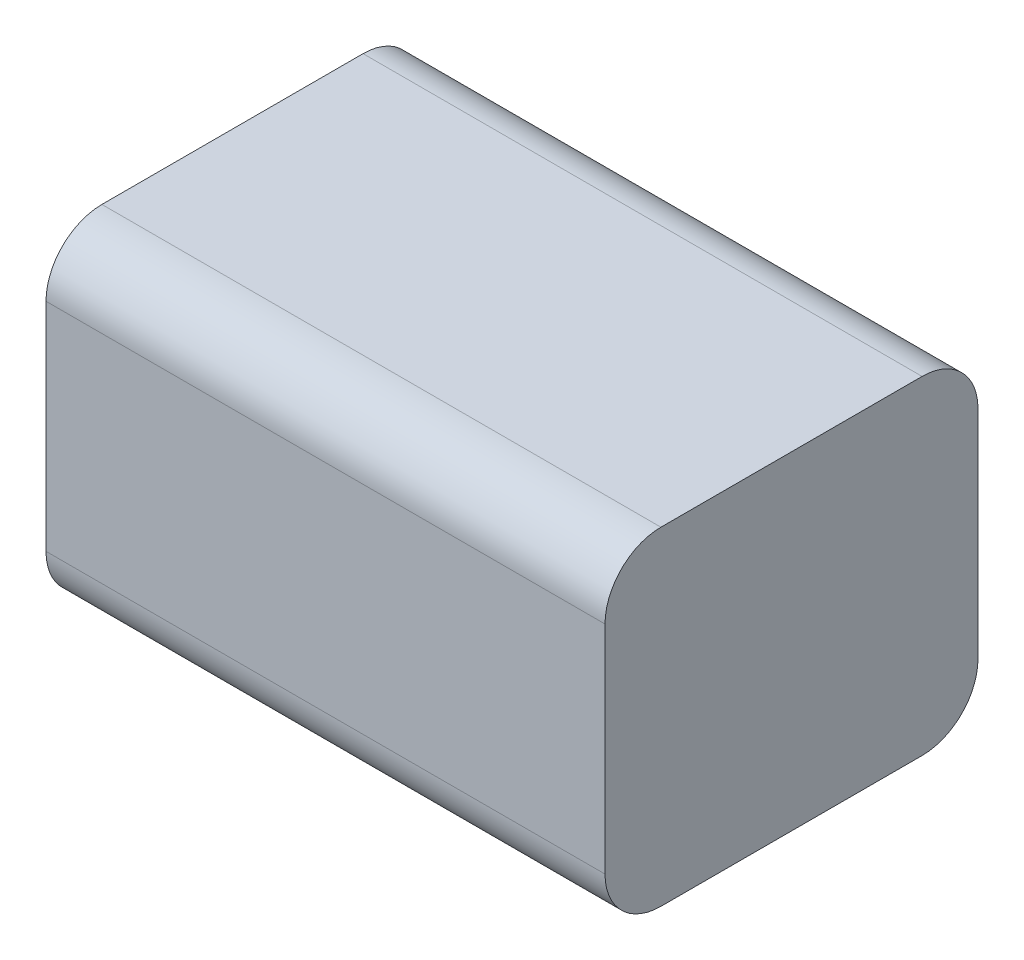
from build123d import *

# Parameters (mm, degrees)
SKETCH1_W           = 33.36
SKETCH1_H           = 29.37
BOSS_EXTRUDE1_DEPTH = 50
FILLET1_R           = 5
SCALE1_SCALE        = 0.7


with BuildPart() as part:
    # Sketch1 → Boss-Extrude1 (new body)
    with BuildSketch(Plane(origin=(0, 0, 0), x_dir=(0, 0, -1), z_dir=(1, 0, 0))):
        Rectangle(SKETCH1_W, SKETCH1_H)
    extrude(amount=BOSS_EXTRUDE1_DEPTH)

    # Fillet1
    fillet1_edges = [part.edges().sort_by_distance(p)[0] for p in [
        (25, -14.685, -16.68),
        (25, -14.685, 16.68),
        (25, 14.685, 16.68),
        (25, 14.685, -16.68),
    ]]
    fillet(fillet1_edges, radius=FILLET1_R)


with BuildPart() as part_1:
    # Scale1: scaled about (25, 0, 0)
    add(part.part.scale(SCALE1_SCALE).moved(Location((7.5, 0, 0))))


solid = part_1.part
